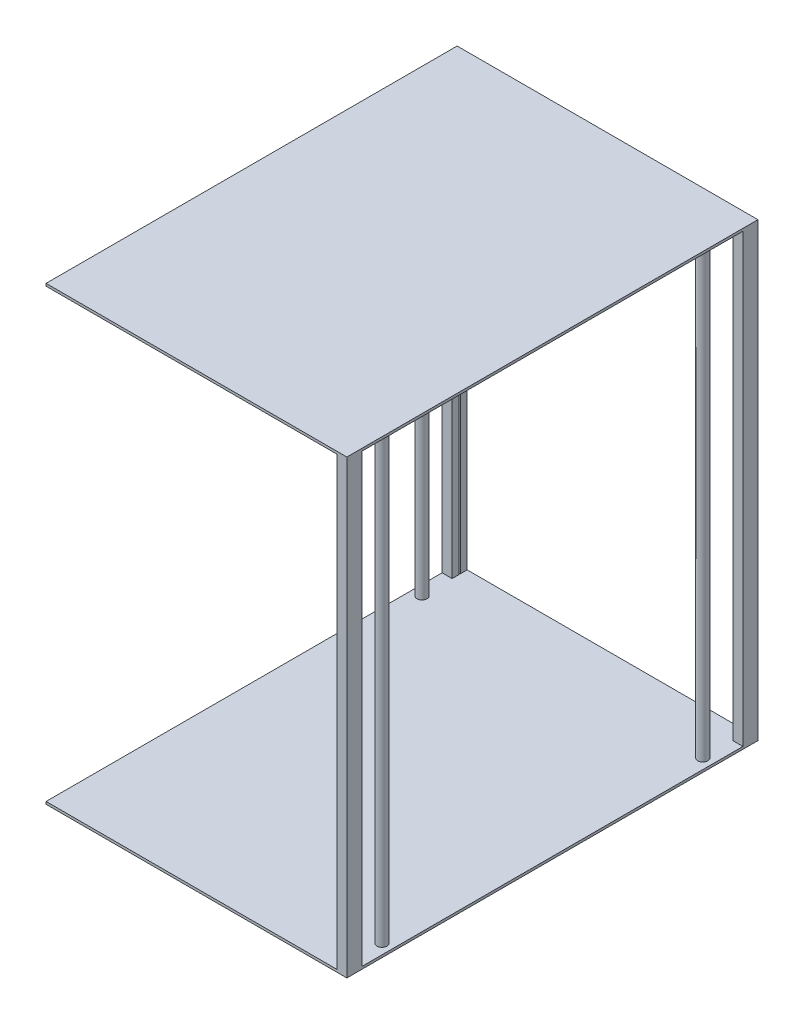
ISO-10303-21;
HEADER;
FILE_DESCRIPTION(('STEP AP214'),'2;1');
FILE_NAME('part.step','',(''),(''),'','','');
FILE_SCHEMA(('AUTOMOTIVE_DESIGN { 1 0 10303 214 1 1 1 1 }'));
ENDSEC;
DATA;
#1=APPLICATION_CONTEXT('core data for automotive mechanical design processes');
#2=APPLICATION_PROTOCOL_DEFINITION('international standard','automotive_design',2000,#1);
#3=PRODUCT_CONTEXT('',#1,'mechanical');
#4=PRODUCT('Part','Part','',(#3));
#5=PRODUCT_RELATED_PRODUCT_CATEGORY('part','',(#4));
#6=PRODUCT_DEFINITION_FORMATION('','',#4);
#7=PRODUCT_DEFINITION_CONTEXT('part definition',#1,'design');
#8=PRODUCT_DEFINITION('design','',#6,#7);
#9=PRODUCT_DEFINITION_SHAPE('','',#8);
#10=(LENGTH_UNIT() NAMED_UNIT(*) SI_UNIT(.MILLI.,.METRE.));
#11=(NAMED_UNIT(*) PLANE_ANGLE_UNIT() SI_UNIT($,.RADIAN.));
#12=(NAMED_UNIT(*) SI_UNIT($,.STERADIAN.) SOLID_ANGLE_UNIT());
#13=UNCERTAINTY_MEASURE_WITH_UNIT(LENGTH_MEASURE(1.E-05),#10,'distance_accuracy_value','');
#14=(GEOMETRIC_REPRESENTATION_CONTEXT(3) GLOBAL_UNCERTAINTY_ASSIGNED_CONTEXT((#13)) GLOBAL_UNIT_ASSIGNED_CONTEXT((#10,
#11,#12)) REPRESENTATION_CONTEXT('',''));
#15=CARTESIAN_POINT('',(0.,0.,0.));
#16=DIRECTION('',(0.,0.,1.));
#17=DIRECTION('',(1.,0.,0.));
#18=AXIS2_PLACEMENT_3D('',#15,#16,#17);
#19=CARTESIAN_POINT('',(-57.3913500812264,2286.,2053.31814208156));
#20=DIRECTION('',(0.,0.,-1.));
#21=DIRECTION('',(-1.,0.,0.));
#22=AXIS2_PLACEMENT_3D('',#19,#20,#21);
#23=PLANE('',#22);
#24=DIRECTION('',(1.,0.,0.));
#25=VECTOR('',#24,1.);
#26=CARTESIAN_POINT('',(-57.3913500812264,0.,2053.31814208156));
#27=LINE('',#26,#25);
#28=CARTESIAN_POINT('',(-57.3913500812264,0.,2053.31814208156));
#29=VERTEX_POINT('',#28);
#30=CARTESIAN_POINT('',(1466.60864991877,0.,2053.31814208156));
#31=VERTEX_POINT('',#30);
#32=EDGE_CURVE('E351',#29,#31,#27,.T.);
#33=ORIENTED_EDGE('',*,*,#32,.T.);
#34=DIRECTION('',(0.,-1.,0.));
#35=VECTOR('',#34,1.);
#36=CARTESIAN_POINT('',(1466.60864991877,2286.,2053.31814208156));
#37=LINE('',#36,#35);
#38=CARTESIAN_POINT('',(1466.60864991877,2286.,2053.31814208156));
#39=VERTEX_POINT('',#38);
#40=EDGE_CURVE('E361',#39,#31,#37,.T.);
#41=ORIENTED_EDGE('',*,*,#40,.F.);
#42=DIRECTION('',(1.,0.,0.));
#43=VECTOR('',#42,1.);
#44=CARTESIAN_POINT('',(-57.3913500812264,2286.,2053.31814208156));
#45=LINE('',#44,#43);
#46=CARTESIAN_POINT('',(-57.3913500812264,2286.,2053.31814208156));
#47=VERTEX_POINT('',#46);
#48=EDGE_CURVE('E203',#47,#39,#45,.T.);
#49=ORIENTED_EDGE('',*,*,#48,.F.);
#50=DIRECTION('',(0.,1.,0.));
#51=VECTOR('',#50,1.);
#52=CARTESIAN_POINT('',(-57.3913500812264,2273.3,2053.31814208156));
#53=LINE('',#52,#51);
#54=CARTESIAN_POINT('',(-57.3913500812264,2273.3,2053.31814208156));
#55=VERTEX_POINT('',#54);
#56=EDGE_CURVE('E188',#55,#47,#53,.T.);
#57=ORIENTED_EDGE('',*,*,#56,.F.);
#58=DIRECTION('',(1.,0.,0.));
#59=VECTOR('',#58,1.);
#60=CARTESIAN_POINT('',(1466.60864991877,2273.3,2053.31814208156));
#61=LINE('',#60,#59);
#62=CARTESIAN_POINT('',(1415.80864991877,2273.3,2053.31814208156));
#63=VERTEX_POINT('',#62);
#64=EDGE_CURVE('E193',#55,#63,#61,.T.);
#65=ORIENTED_EDGE('',*,*,#64,.T.);
#66=DIRECTION('',(0.,1.,0.));
#67=VECTOR('',#66,1.);
#68=CARTESIAN_POINT('',(1415.80864991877,12.7000000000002,2053.31814208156));
#69=LINE('',#68,#67);
#70=CARTESIAN_POINT('',(1415.80864991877,12.7000000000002,2053.31814208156));
#71=VERTEX_POINT('',#70);
#72=EDGE_CURVE('E295',#71,#63,#69,.T.);
#73=ORIENTED_EDGE('',*,*,#72,.F.);
#74=DIRECTION('',(1.,0.,0.));
#75=VECTOR('',#74,1.);
#76=CARTESIAN_POINT('',(-1302.9396218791,12.7000000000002,2053.31814208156));
#77=LINE('',#76,#75);
#78=CARTESIAN_POINT('',(-57.3913500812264,12.7000000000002,2053.31814208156));
#79=VERTEX_POINT('',#78);
#80=EDGE_CURVE('E245',#79,#71,#77,.T.);
#81=ORIENTED_EDGE('',*,*,#80,.F.);
#82=DIRECTION('',(0.,-1.,0.));
#83=VECTOR('',#82,1.);
#84=CARTESIAN_POINT('',(-57.3913500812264,2286.,2053.31814208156));
#85=LINE('',#84,#83);
#86=EDGE_CURVE('E362',#79,#29,#85,.T.);
#87=ORIENTED_EDGE('',*,*,#86,.T.);
#88=EDGE_LOOP('',(#33,#41,#49,#57,#65,#73,#81,#87));
#89=FACE_BOUND('',#88,.T.);
#90=ADVANCED_FACE('F33',(#89),#23,.F.);
#91=CARTESIAN_POINT('',(-57.3913500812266,2286.,-29.4818579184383));
#92=DIRECTION('',(1.,0.,0.));
#93=DIRECTION('',(0.,0.,-1.));
#94=AXIS2_PLACEMENT_3D('',#91,#92,#93);
#95=PLANE('',#94);
#96=DIRECTION('',(0.,1.,0.));
#97=VECTOR('',#96,1.);
#98=CARTESIAN_POINT('',(-57.3913500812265,12.7000000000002,46.7181420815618));
#99=LINE('',#98,#97);
#100=CARTESIAN_POINT('',(-57.3913500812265,12.7000000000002,46.7181420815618));
#101=VERTEX_POINT('',#100);
#102=CARTESIAN_POINT('',(-57.3913500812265,2273.3,46.7181420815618));
#103=VERTEX_POINT('',#102);
#104=EDGE_CURVE('E190',#101,#103,#99,.T.);
#105=ORIENTED_EDGE('',*,*,#104,.T.);
#106=DIRECTION('',(0.,0.,1.));
#107=VECTOR('',#106,1.);
#108=CARTESIAN_POINT('',(-57.3913500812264,2273.3,-29.4818579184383));
#109=LINE('',#108,#107);
#110=EDGE_CURVE('E185',#103,#55,#109,.T.);
#111=ORIENTED_EDGE('',*,*,#110,.T.);
#112=ORIENTED_EDGE('',*,*,#56,.T.);
#113=DIRECTION('',(0.,0.,1.));
#114=VECTOR('',#113,1.);
#115=CARTESIAN_POINT('',(-57.3913500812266,2286.,-29.4818579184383));
#116=LINE('',#115,#114);
#117=CARTESIAN_POINT('',(-57.3913500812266,2286.,-29.4818579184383));
#118=VERTEX_POINT('',#117);
#119=EDGE_CURVE('E340',#118,#47,#116,.T.);
#120=ORIENTED_EDGE('',*,*,#119,.F.);
#121=DIRECTION('',(0.,-1.,0.));
#122=VECTOR('',#121,1.);
#123=CARTESIAN_POINT('',(-57.3913500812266,2286.,-29.4818579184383));
#124=LINE('',#123,#122);
#125=CARTESIAN_POINT('',(-57.3913500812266,0.,-29.4818579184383));
#126=VERTEX_POINT('',#125);
#127=EDGE_CURVE('E348',#118,#126,#124,.T.);
#128=ORIENTED_EDGE('',*,*,#127,.T.);
#129=DIRECTION('',(0.,0.,1.));
#130=VECTOR('',#129,1.);
#131=CARTESIAN_POINT('',(-57.3913500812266,0.,-29.4818579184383));
#132=LINE('',#131,#130);
#133=EDGE_CURVE('E297',#126,#29,#132,.T.);
#134=ORIENTED_EDGE('',*,*,#133,.T.);
#135=ORIENTED_EDGE('',*,*,#86,.F.);
#136=DIRECTION('',(0.,0.,1.));
#137=VECTOR('',#136,1.);
#138=CARTESIAN_POINT('',(-57.3913500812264,12.7000000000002,1011.91814208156));
#139=LINE('',#138,#137);
#140=EDGE_CURVE('E243',#101,#79,#139,.T.);
#141=ORIENTED_EDGE('',*,*,#140,.F.);
#142=EDGE_LOOP('',(#105,#111,#112,#120,#128,#134,#135,#141));
#143=FACE_BOUND('',#142,.T.);
#144=ADVANCED_FACE('F35',(#143),#95,.F.);
#145=CARTESIAN_POINT('',(1466.60864991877,2286.,-29.4818579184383));
#146=DIRECTION('',(-1.,0.,0.));
#147=DIRECTION('',(0.,0.,1.));
#148=AXIS2_PLACEMENT_3D('',#145,#146,#147);
#149=PLANE('',#148);
#150=DIRECTION('',(0.,0.,-1.));
#151=VECTOR('',#150,1.);
#152=CARTESIAN_POINT('',(1466.60864991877,2273.3,-29.4818579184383));
#153=LINE('',#152,#151);
#154=CARTESIAN_POINT('',(1466.60864991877,2273.3,1977.11814208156));
#155=VERTEX_POINT('',#154);
#156=CARTESIAN_POINT('',(1466.60864991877,2273.3,46.7181420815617));
#157=VERTEX_POINT('',#156);
#158=EDGE_CURVE('E648',#155,#157,#153,.T.);
#159=ORIENTED_EDGE('',*,*,#158,.T.);
#160=DIRECTION('',(0.,1.,0.));
#161=VECTOR('',#160,1.);
#162=CARTESIAN_POINT('',(1466.60864991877,12.7000000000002,46.7181420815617));
#163=LINE('',#162,#161);
#164=CARTESIAN_POINT('',(1466.60864991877,12.7000000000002,46.7181420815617));
#165=VERTEX_POINT('',#164);
#166=EDGE_CURVE('E331',#165,#157,#163,.T.);
#167=ORIENTED_EDGE('',*,*,#166,.F.);
#168=DIRECTION('',(0.,0.,-1.));
#169=VECTOR('',#168,1.);
#170=CARTESIAN_POINT('',(1466.60864991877,12.7000000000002,1011.91814208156));
#171=LINE('',#170,#169);
#172=CARTESIAN_POINT('',(1466.60864991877,12.7000000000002,1977.11814208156));
#173=VERTEX_POINT('',#172);
#174=EDGE_CURVE('E252',#173,#165,#171,.T.);
#175=ORIENTED_EDGE('',*,*,#174,.F.);
#176=DIRECTION('',(0.,1.,0.));
#177=VECTOR('',#176,1.);
#178=CARTESIAN_POINT('',(1466.60864991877,12.7000000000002,1977.11814208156));
#179=LINE('',#178,#177);
#180=EDGE_CURVE('E333',#173,#155,#179,.T.);
#181=ORIENTED_EDGE('',*,*,#180,.T.);
#182=EDGE_LOOP('',(#159,#167,#175,#181));
#183=FACE_BOUND('',#182,.T.);
#184=DIRECTION('',(0.,0.,-1.));
#185=VECTOR('',#184,1.);
#186=CARTESIAN_POINT('',(1466.60864991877,0.,-29.4818579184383));
#187=LINE('',#186,#185);
#188=CARTESIAN_POINT('',(1466.60864991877,0.,-29.4818579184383));
#189=VERTEX_POINT('',#188);
#190=EDGE_CURVE('E353',#31,#189,#187,.T.);
#191=ORIENTED_EDGE('',*,*,#190,.T.);
#192=DIRECTION('',(0.,-1.,0.));
#193=VECTOR('',#192,1.);
#194=CARTESIAN_POINT('',(1466.60864991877,2286.,-29.4818579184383));
#195=LINE('',#194,#193);
#196=CARTESIAN_POINT('',(1466.60864991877,2286.,-29.4818579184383));
#197=VERTEX_POINT('',#196);
#198=EDGE_CURVE('E359',#197,#189,#195,.T.);
#199=ORIENTED_EDGE('',*,*,#198,.F.);
#200=DIRECTION('',(0.,0.,-1.));
#201=VECTOR('',#200,1.);
#202=CARTESIAN_POINT('',(1466.60864991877,2286.,-29.4818579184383));
#203=LINE('',#202,#201);
#204=EDGE_CURVE('E344',#39,#197,#203,.T.);
#205=ORIENTED_EDGE('',*,*,#204,.F.);
#206=ORIENTED_EDGE('',*,*,#40,.T.);
#207=EDGE_LOOP('',(#191,#199,#205,#206));
#208=FACE_BOUND('',#207,.T.);
#209=ADVANCED_FACE('F391',(#183,#208),#149,.F.);
#210=CARTESIAN_POINT('',(-57.3913500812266,2286.,-29.4818579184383));
#211=DIRECTION('',(0.,0.,1.));
#212=DIRECTION('',(1.,0.,0.));
#213=AXIS2_PLACEMENT_3D('',#210,#211,#212);
#214=PLANE('',#213);
#215=DIRECTION('',(-1.,0.,0.));
#216=VECTOR('',#215,1.);
#217=CARTESIAN_POINT('',(1466.60864991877,2273.3,-29.4818579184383));
#218=LINE('',#217,#216);
#219=CARTESIAN_POINT('',(1415.80864991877,2273.3,-29.4818579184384));
#220=VERTEX_POINT('',#219);
#221=CARTESIAN_POINT('',(-6.59135008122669,2273.3,-29.4818579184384));
#222=VERTEX_POINT('',#221);
#223=EDGE_CURVE('E194',#220,#222,#218,.T.);
#224=ORIENTED_EDGE('',*,*,#223,.T.);
#225=DIRECTION('',(0.,1.,0.));
#226=VECTOR('',#225,1.);
#227=CARTESIAN_POINT('',(-6.59135008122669,12.7000000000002,-29.4818579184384));
#228=LINE('',#227,#226);
#229=CARTESIAN_POINT('',(-6.59135008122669,12.7000000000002,-29.4818579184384));
#230=VERTEX_POINT('',#229);
#231=EDGE_CURVE('E311',#230,#222,#228,.T.);
#232=ORIENTED_EDGE('',*,*,#231,.F.);
#233=DIRECTION('',(-1.,0.,0.));
#234=VECTOR('',#233,1.);
#235=CARTESIAN_POINT('',(-1302.9396218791,12.7000000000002,-29.4818579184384));
#236=LINE('',#235,#234);
#237=CARTESIAN_POINT('',(1415.80864991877,12.7000000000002,-29.4818579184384));
#238=VERTEX_POINT('',#237);
#239=EDGE_CURVE('E268',#238,#230,#236,.T.);
#240=ORIENTED_EDGE('',*,*,#239,.F.);
#241=DIRECTION('',(0.,1.,0.));
#242=VECTOR('',#241,1.);
#243=CARTESIAN_POINT('',(1415.80864991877,12.7000000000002,-29.4818579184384));
#244=LINE('',#243,#242);
#245=EDGE_CURVE('E313',#238,#220,#244,.T.);
#246=ORIENTED_EDGE('',*,*,#245,.T.);
#247=EDGE_LOOP('',(#224,#232,#240,#246));
#248=FACE_BOUND('',#247,.T.);
#249=DIRECTION('',(-1.,0.,0.));
#250=VECTOR('',#249,1.);
#251=CARTESIAN_POINT('',(-57.3913500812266,0.,-29.4818579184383));
#252=LINE('',#251,#250);
#253=EDGE_CURVE('E342',#189,#126,#252,.T.);
#254=ORIENTED_EDGE('',*,*,#253,.T.);
#255=ORIENTED_EDGE('',*,*,#127,.F.);
#256=DIRECTION('',(-1.,0.,0.));
#257=VECTOR('',#256,1.);
#258=CARTESIAN_POINT('',(-57.3913500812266,2286.,-29.4818579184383));
#259=LINE('',#258,#257);
#260=EDGE_CURVE('E346',#197,#118,#259,.T.);
#261=ORIENTED_EDGE('',*,*,#260,.F.);
#262=ORIENTED_EDGE('',*,*,#198,.T.);
#263=EDGE_LOOP('',(#254,#255,#261,#262));
#264=FACE_BOUND('',#263,.T.);
#265=ADVANCED_FACE('F395',(#248,#264),#214,.F.);
#266=CARTESIAN_POINT('',(-57.3913500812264,2286.,2053.31814208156));
#267=DIRECTION('',(0.,1.,0.));
#268=DIRECTION('',(0.,0.,1.));
#269=AXIS2_PLACEMENT_3D('',#266,#267,#268);
#270=PLANE('',#269);
#271=ORIENTED_EDGE('',*,*,#119,.T.);
#272=ORIENTED_EDGE('',*,*,#48,.T.);
#273=ORIENTED_EDGE('',*,*,#204,.T.);
#274=ORIENTED_EDGE('',*,*,#260,.T.);
#275=EDGE_LOOP('',(#271,#272,#273,#274));
#276=FACE_BOUND('',#275,.T.);
#277=ADVANCED_FACE('F399',(#276),#270,.T.);
#278=CARTESIAN_POINT('',(-57.3913500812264,0.,2053.31814208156));
#279=DIRECTION('',(0.,1.,0.));
#280=DIRECTION('',(0.,0.,1.));
#281=AXIS2_PLACEMENT_3D('',#278,#279,#280);
#282=PLANE('',#281);
#283=ORIENTED_EDGE('',*,*,#133,.F.);
#284=ORIENTED_EDGE('',*,*,#253,.F.);
#285=ORIENTED_EDGE('',*,*,#190,.F.);
#286=ORIENTED_EDGE('',*,*,#32,.F.);
#287=EDGE_LOOP('',(#283,#284,#285,#286));
#288=FACE_BOUND('',#287,.T.);
#289=ADVANCED_FACE('F401',(#288),#282,.F.);
#290=CARTESIAN_POINT('',(-1302.9396218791,12.7000000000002,46.718142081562));
#291=DIRECTION('',(0.,0.,-1.));
#292=DIRECTION('',(-1.,0.,0.));
#293=AXIS2_PLACEMENT_3D('',#290,#291,#292);
#294=PLANE('',#293);
#295=DIRECTION('',(0.,1.,0.));
#296=VECTOR('',#295,1.);
#297=CARTESIAN_POINT('',(-6.59135008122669,12.7000000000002,46.7181420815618));
#298=LINE('',#297,#296);
#299=CARTESIAN_POINT('',(-6.59135008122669,12.7000000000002,46.7181420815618));
#300=VERTEX_POINT('',#299);
#301=CARTESIAN_POINT('',(-6.59135008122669,2273.3,46.7181420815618));
#302=VERTEX_POINT('',#301);
#303=EDGE_CURVE('E298',#300,#302,#298,.T.);
#304=ORIENTED_EDGE('',*,*,#303,.T.);
#305=DIRECTION('',(-1.,0.,0.));
#306=VECTOR('',#305,1.);
#307=CARTESIAN_POINT('',(-1302.9396218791,2273.3,46.718142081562));
#308=LINE('',#307,#306);
#309=EDGE_CURVE('E50',#302,#103,#308,.T.);
#310=ORIENTED_EDGE('',*,*,#309,.T.);
#311=ORIENTED_EDGE('',*,*,#104,.F.);
#312=DIRECTION('',(-1.,0.,0.));
#313=VECTOR('',#312,1.);
#314=CARTESIAN_POINT('',(-1302.9396218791,12.7000000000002,46.718142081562));
#315=LINE('',#314,#313);
#316=EDGE_CURVE('E283',#300,#101,#315,.T.);
#317=ORIENTED_EDGE('',*,*,#316,.F.);
#318=EDGE_LOOP('',(#304,#310,#311,#317));
#319=FACE_BOUND('',#318,.T.);
#320=ADVANCED_FACE('F404',(#319),#294,.F.);
#321=CARTESIAN_POINT('',(-6.59135008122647,12.7000000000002,1011.91814208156));
#322=DIRECTION('',(-1.,0.,0.));
#323=DIRECTION('',(0.,0.,1.));
#324=AXIS2_PLACEMENT_3D('',#321,#322,#323);
#325=PLANE('',#324);
#326=DIRECTION('',(0.,1.,0.));
#327=VECTOR('',#326,1.);
#328=CARTESIAN_POINT('',(-6.59135008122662,12.7000000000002,11.7931420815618));
#329=LINE('',#328,#327);
#330=CARTESIAN_POINT('',(-6.59135008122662,12.7000000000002,11.7931420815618));
#331=VERTEX_POINT('',#330);
#332=CARTESIAN_POINT('',(-6.59135008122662,2273.3,11.7931420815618));
#333=VERTEX_POINT('',#332);
#334=EDGE_CURVE('E300',#331,#333,#329,.T.);
#335=ORIENTED_EDGE('',*,*,#334,.T.);
#336=DIRECTION('',(0.,0.,1.));
#337=VECTOR('',#336,1.);
#338=CARTESIAN_POINT('',(-6.59135008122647,2273.3,1011.91814208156));
#339=LINE('',#338,#337);
#340=EDGE_CURVE('E58',#333,#302,#339,.T.);
#341=ORIENTED_EDGE('',*,*,#340,.T.);
#342=ORIENTED_EDGE('',*,*,#303,.F.);
#343=DIRECTION('',(0.,0.,1.));
#344=VECTOR('',#343,1.);
#345=CARTESIAN_POINT('',(-6.59135008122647,12.7000000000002,1011.91814208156));
#346=LINE('',#345,#344);
#347=EDGE_CURVE('E275',#331,#300,#346,.T.);
#348=ORIENTED_EDGE('',*,*,#347,.F.);
#349=EDGE_LOOP('',(#335,#341,#342,#348));
#350=FACE_BOUND('',#349,.T.);
#351=ADVANCED_FACE('F451',(#350),#325,.F.);
#352=CARTESIAN_POINT('',(-1302.9396218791,12.7000000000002,11.7931420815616));
#353=DIRECTION('',(0.,0.,-1.));
#354=DIRECTION('',(-1.,0.,0.));
#355=AXIS2_PLACEMENT_3D('',#352,#353,#354);
#356=PLANE('',#355);
#357=DIRECTION('',(-1.,0.,0.));
#358=VECTOR('',#357,1.);
#359=CARTESIAN_POINT('',(-1302.9396218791,2273.3,11.7931420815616));
#360=LINE('',#359,#358);
#361=CARTESIAN_POINT('',(-31.9913500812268,2273.3,11.7931420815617));
#362=VERTEX_POINT('',#361);
#363=EDGE_CURVE('E238',#333,#362,#360,.T.);
#364=ORIENTED_EDGE('',*,*,#363,.F.);
#365=ORIENTED_EDGE('',*,*,#334,.F.);
#366=DIRECTION('',(-1.,0.,0.));
#367=VECTOR('',#366,1.);
#368=CARTESIAN_POINT('',(-1302.9396218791,12.7000000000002,11.7931420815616));
#369=LINE('',#368,#367);
#370=CARTESIAN_POINT('',(-31.9913500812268,12.7000000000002,11.7931420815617));
#371=VERTEX_POINT('',#370);
#372=EDGE_CURVE('E281',#331,#371,#369,.T.);
#373=ORIENTED_EDGE('',*,*,#372,.T.);
#374=DIRECTION('',(0.,1.,0.));
#375=VECTOR('',#374,1.);
#376=CARTESIAN_POINT('',(-31.9913500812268,12.7000000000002,11.7931420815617));
#377=LINE('',#376,#375);
#378=EDGE_CURVE('E302',#371,#362,#377,.T.);
#379=ORIENTED_EDGE('',*,*,#378,.T.);
#380=EDGE_LOOP('',(#364,#365,#373,#379));
#381=FACE_BOUND('',#380,.T.);
#382=ADVANCED_FACE('F447',(#381),#356,.T.);
#383=CARTESIAN_POINT('',(-31.9913500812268,12.7000000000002,1011.91814208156));
#384=DIRECTION('',(-1.,0.,0.));
#385=DIRECTION('',(0.,0.,1.));
#386=AXIS2_PLACEMENT_3D('',#383,#384,#385);
#387=PLANE('',#386);
#388=DIRECTION('',(0.,1.,0.));
#389=VECTOR('',#388,1.);
#390=CARTESIAN_POINT('',(-31.9913500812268,12.7000000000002,5.44314208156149));
#391=LINE('',#390,#389);
#392=CARTESIAN_POINT('',(-31.9913500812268,12.7000000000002,5.44314208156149));
#393=VERTEX_POINT('',#392);
#394=CARTESIAN_POINT('',(-31.9913500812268,2273.3,5.44314208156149));
#395=VERTEX_POINT('',#394);
#396=EDGE_CURVE('E305',#393,#395,#391,.T.);
#397=ORIENTED_EDGE('',*,*,#396,.T.);
#398=DIRECTION('',(0.,0.,1.));
#399=VECTOR('',#398,1.);
#400=CARTESIAN_POINT('',(-31.9913500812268,2273.3,1011.91814208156));
#401=LINE('',#400,#399);
#402=EDGE_CURVE('E236',#395,#362,#401,.T.);
#403=ORIENTED_EDGE('',*,*,#402,.T.);
#404=ORIENTED_EDGE('',*,*,#378,.F.);
#405=DIRECTION('',(0.,0.,1.));
#406=VECTOR('',#405,1.);
#407=CARTESIAN_POINT('',(-31.9913500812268,12.7000000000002,1011.91814208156));
#408=LINE('',#407,#406);
#409=EDGE_CURVE('E278',#393,#371,#408,.T.);
#410=ORIENTED_EDGE('',*,*,#409,.F.);
#411=EDGE_LOOP('',(#397,#403,#404,#410));
#412=FACE_BOUND('',#411,.T.);
#413=ADVANCED_FACE('F443',(#412),#387,.F.);
#414=CARTESIAN_POINT('',(-1302.9396218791,12.7000000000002,5.44314208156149));
#415=DIRECTION('',(0.,0.,-1.));
#416=DIRECTION('',(-1.,0.,0.));
#417=AXIS2_PLACEMENT_3D('',#414,#415,#416);
#418=PLANE('',#417);
#419=DIRECTION('',(0.,1.,0.));
#420=VECTOR('',#419,1.);
#421=CARTESIAN_POINT('',(-6.59135008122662,12.7000000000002,5.44314208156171));
#422=LINE('',#421,#420);
#423=CARTESIAN_POINT('',(-6.59135008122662,12.7000000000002,5.44314208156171));
#424=VERTEX_POINT('',#423);
#425=CARTESIAN_POINT('',(-6.59135008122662,2273.3,5.44314208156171));
#426=VERTEX_POINT('',#425);
#427=EDGE_CURVE('E308',#424,#426,#422,.T.);
#428=ORIENTED_EDGE('',*,*,#427,.T.);
#429=DIRECTION('',(-1.,0.,0.));
#430=VECTOR('',#429,1.);
#431=CARTESIAN_POINT('',(-1302.9396218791,2273.3,5.44314208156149));
#432=LINE('',#431,#430);
#433=EDGE_CURVE('E234',#426,#395,#432,.T.);
#434=ORIENTED_EDGE('',*,*,#433,.T.);
#435=ORIENTED_EDGE('',*,*,#396,.F.);
#436=DIRECTION('',(-1.,0.,0.));
#437=VECTOR('',#436,1.);
#438=CARTESIAN_POINT('',(-1302.9396218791,12.7000000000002,5.44314208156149));
#439=LINE('',#438,#437);
#440=EDGE_CURVE('E274',#424,#393,#439,.T.);
#441=ORIENTED_EDGE('',*,*,#440,.F.);
#442=EDGE_LOOP('',(#428,#434,#435,#441));
#443=FACE_BOUND('',#442,.T.);
#444=ADVANCED_FACE('F440',(#443),#418,.F.);
#445=ORIENTED_EDGE('',*,*,#231,.T.);
#446=DIRECTION('',(0.,0.,1.));
#447=VECTOR('',#446,1.);
#448=CARTESIAN_POINT('',(-6.59135008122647,2273.3,1011.91814208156));
#449=LINE('',#448,#447);
#450=EDGE_CURVE('E232',#222,#426,#449,.T.);
#451=ORIENTED_EDGE('',*,*,#450,.T.);
#452=ORIENTED_EDGE('',*,*,#427,.F.);
#453=EDGE_CURVE('E271',#230,#424,#346,.T.);
#454=ORIENTED_EDGE('',*,*,#453,.F.);
#455=EDGE_LOOP('',(#445,#451,#452,#454));
#456=FACE_BOUND('',#455,.T.);
#457=ADVANCED_FACE('F438',(#456),#325,.F.);
#458=CARTESIAN_POINT('',(1415.80864991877,12.7000000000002,1011.91814208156));
#459=DIRECTION('',(-1.,0.,0.));
#460=DIRECTION('',(0.,0.,1.));
#461=AXIS2_PLACEMENT_3D('',#458,#459,#460);
#462=PLANE('',#461);
#463=DIRECTION('',(0.,0.,1.));
#464=VECTOR('',#463,1.);
#465=CARTESIAN_POINT('',(1415.80864991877,2273.3,1011.91814208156));
#466=LINE('',#465,#464);
#467=CARTESIAN_POINT('',(1415.80864991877,2273.3,5.44314208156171));
#468=VERTEX_POINT('',#467);
#469=EDGE_CURVE('E229',#220,#468,#466,.T.);
#470=ORIENTED_EDGE('',*,*,#469,.F.);
#471=ORIENTED_EDGE('',*,*,#245,.F.);
#472=DIRECTION('',(0.,0.,1.));
#473=VECTOR('',#472,1.);
#474=CARTESIAN_POINT('',(1415.80864991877,12.7000000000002,1011.91814208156));
#475=LINE('',#474,#473);
#476=CARTESIAN_POINT('',(1415.80864991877,12.7000000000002,5.44314208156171));
#477=VERTEX_POINT('',#476);
#478=EDGE_CURVE('E261',#238,#477,#475,.T.);
#479=ORIENTED_EDGE('',*,*,#478,.T.);
#480=DIRECTION('',(0.,1.,0.));
#481=VECTOR('',#480,1.);
#482=CARTESIAN_POINT('',(1415.80864991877,12.7000000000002,5.44314208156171));
#483=LINE('',#482,#481);
#484=EDGE_CURVE('E316',#477,#468,#483,.T.);
#485=ORIENTED_EDGE('',*,*,#484,.T.);
#486=EDGE_LOOP('',(#470,#471,#479,#485));
#487=FACE_BOUND('',#486,.T.);
#488=ADVANCED_FACE('F434',(#487),#462,.T.);
#489=CARTESIAN_POINT('',(-1302.9396218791,12.7000000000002,5.44314208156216));
#490=DIRECTION('',(0.,0.,1.));
#491=DIRECTION('',(1.,0.,0.));
#492=AXIS2_PLACEMENT_3D('',#489,#490,#491);
#493=PLANE('',#492);
#494=DIRECTION('',(1.,0.,0.));
#495=VECTOR('',#494,1.);
#496=CARTESIAN_POINT('',(-1302.9396218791,2273.3,5.44314208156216));
#497=LINE('',#496,#495);
#498=CARTESIAN_POINT('',(1441.20864991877,2273.3,5.44314208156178));
#499=VERTEX_POINT('',#498);
#500=EDGE_CURVE('E226',#468,#499,#497,.T.);
#501=ORIENTED_EDGE('',*,*,#500,.F.);
#502=ORIENTED_EDGE('',*,*,#484,.F.);
#503=DIRECTION('',(1.,0.,0.));
#504=VECTOR('',#503,1.);
#505=CARTESIAN_POINT('',(-1302.9396218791,12.7000000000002,5.44314208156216));
#506=LINE('',#505,#504);
#507=CARTESIAN_POINT('',(1441.20864991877,12.7000000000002,5.44314208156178));
#508=VERTEX_POINT('',#507);
#509=EDGE_CURVE('E266',#477,#508,#506,.T.);
#510=ORIENTED_EDGE('',*,*,#509,.T.);
#511=DIRECTION('',(0.,1.,0.));
#512=VECTOR('',#511,1.);
#513=CARTESIAN_POINT('',(1441.20864991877,12.7000000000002,5.44314208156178));
#514=LINE('',#513,#512);
#515=EDGE_CURVE('E319',#508,#499,#514,.T.);
#516=ORIENTED_EDGE('',*,*,#515,.T.);
#517=EDGE_LOOP('',(#501,#502,#510,#516));
#518=FACE_BOUND('',#517,.T.);
#519=ADVANCED_FACE('F430',(#518),#493,.T.);
#520=CARTESIAN_POINT('',(1441.20864991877,12.7000000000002,1011.91814208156));
#521=DIRECTION('',(-1.,0.,0.));
#522=DIRECTION('',(0.,0.,1.));
#523=AXIS2_PLACEMENT_3D('',#520,#521,#522);
#524=PLANE('',#523);
#525=DIRECTION('',(0.,0.,1.));
#526=VECTOR('',#525,1.);
#527=CARTESIAN_POINT('',(1441.20864991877,2273.3,1011.91814208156));
#528=LINE('',#527,#526);
#529=CARTESIAN_POINT('',(1441.20864991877,2273.3,11.7931420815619));
#530=VERTEX_POINT('',#529);
#531=EDGE_CURVE('E223',#499,#530,#528,.T.);
#532=ORIENTED_EDGE('',*,*,#531,.F.);
#533=ORIENTED_EDGE('',*,*,#515,.F.);
#534=DIRECTION('',(0.,0.,1.));
#535=VECTOR('',#534,1.);
#536=CARTESIAN_POINT('',(1441.20864991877,12.7000000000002,1011.91814208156));
#537=LINE('',#536,#535);
#538=CARTESIAN_POINT('',(1441.20864991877,12.7000000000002,11.7931420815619));
#539=VERTEX_POINT('',#538);
#540=EDGE_CURVE('E264',#508,#539,#537,.T.);
#541=ORIENTED_EDGE('',*,*,#540,.T.);
#542=DIRECTION('',(0.,1.,0.));
#543=VECTOR('',#542,1.);
#544=CARTESIAN_POINT('',(1441.20864991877,12.7000000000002,11.7931420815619));
#545=LINE('',#544,#543);
#546=EDGE_CURVE('E322',#539,#530,#545,.T.);
#547=ORIENTED_EDGE('',*,*,#546,.T.);
#548=EDGE_LOOP('',(#532,#533,#541,#547));
#549=FACE_BOUND('',#548,.T.);
#550=ADVANCED_FACE('F426',(#549),#524,.T.);
#551=CARTESIAN_POINT('',(-1302.9396218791,12.7000000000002,11.7931420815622));
#552=DIRECTION('',(0.,0.,1.));
#553=DIRECTION('',(1.,0.,0.));
#554=AXIS2_PLACEMENT_3D('',#551,#552,#553);
#555=PLANE('',#554);
#556=DIRECTION('',(0.,1.,0.));
#557=VECTOR('',#556,1.);
#558=CARTESIAN_POINT('',(1415.80864991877,12.7000000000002,11.7931420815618));
#559=LINE('',#558,#557);
#560=CARTESIAN_POINT('',(1415.80864991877,12.7000000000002,11.7931420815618));
#561=VERTEX_POINT('',#560);
#562=CARTESIAN_POINT('',(1415.80864991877,2273.3,11.7931420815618));
#563=VERTEX_POINT('',#562);
#564=EDGE_CURVE('E325',#561,#563,#559,.T.);
#565=ORIENTED_EDGE('',*,*,#564,.T.);
#566=DIRECTION('',(1.,0.,0.));
#567=VECTOR('',#566,1.);
#568=CARTESIAN_POINT('',(-1302.9396218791,2273.3,11.7931420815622));
#569=LINE('',#568,#567);
#570=EDGE_CURVE('E221',#563,#530,#569,.T.);
#571=ORIENTED_EDGE('',*,*,#570,.T.);
#572=ORIENTED_EDGE('',*,*,#546,.F.);
#573=DIRECTION('',(1.,0.,0.));
#574=VECTOR('',#573,1.);
#575=CARTESIAN_POINT('',(-1302.9396218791,12.7000000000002,11.7931420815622));
#576=LINE('',#575,#574);
#577=EDGE_CURVE('E260',#561,#539,#576,.T.);
#578=ORIENTED_EDGE('',*,*,#577,.F.);
#579=EDGE_LOOP('',(#565,#571,#572,#578));
#580=FACE_BOUND('',#579,.T.);
#581=ADVANCED_FACE('F423',(#580),#555,.F.);
#582=DIRECTION('',(0.,0.,1.));
#583=VECTOR('',#582,1.);
#584=CARTESIAN_POINT('',(1415.80864991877,2273.3,1011.91814208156));
#585=LINE('',#584,#583);
#586=CARTESIAN_POINT('',(1415.80864991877,2273.3,46.7181420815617));
#587=VERTEX_POINT('',#586);
#588=EDGE_CURVE('E218',#563,#587,#585,.T.);
#589=ORIENTED_EDGE('',*,*,#588,.F.);
#590=ORIENTED_EDGE('',*,*,#564,.F.);
#591=CARTESIAN_POINT('',(1415.80864991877,12.7000000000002,46.7181420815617));
#592=VERTEX_POINT('',#591);
#593=EDGE_CURVE('E258',#561,#592,#475,.T.);
#594=ORIENTED_EDGE('',*,*,#593,.T.);
#595=DIRECTION('',(0.,1.,0.));
#596=VECTOR('',#595,1.);
#597=CARTESIAN_POINT('',(1415.80864991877,12.7000000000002,46.7181420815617));
#598=LINE('',#597,#596);
#599=EDGE_CURVE('E328',#592,#587,#598,.T.);
#600=ORIENTED_EDGE('',*,*,#599,.T.);
#601=EDGE_LOOP('',(#589,#590,#594,#600));
#602=FACE_BOUND('',#601,.T.);
#603=ADVANCED_FACE('F421',(#602),#462,.T.);
#604=CARTESIAN_POINT('',(-1302.9396218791,12.7000000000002,46.718142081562));
#605=DIRECTION('',(0.,0.,-1.));
#606=DIRECTION('',(-1.,0.,0.));
#607=AXIS2_PLACEMENT_3D('',#604,#605,#606);
#608=PLANE('',#607);
#609=ORIENTED_EDGE('',*,*,#166,.T.);
#610=DIRECTION('',(-1.,0.,0.));
#611=VECTOR('',#610,1.);
#612=CARTESIAN_POINT('',(-1302.9396218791,2273.3,46.718142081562));
#613=LINE('',#612,#611);
#614=EDGE_CURVE('E216',#157,#587,#613,.T.);
#615=ORIENTED_EDGE('',*,*,#614,.T.);
#616=ORIENTED_EDGE('',*,*,#599,.F.);
#617=DIRECTION('',(-1.,0.,0.));
#618=VECTOR('',#617,1.);
#619=CARTESIAN_POINT('',(-1302.9396218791,12.7000000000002,46.718142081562));
#620=LINE('',#619,#618);
#621=EDGE_CURVE('E255',#165,#592,#620,.T.);
#622=ORIENTED_EDGE('',*,*,#621,.F.);
#623=EDGE_LOOP('',(#609,#615,#616,#622));
#624=FACE_BOUND('',#623,.T.);
#625=ADVANCED_FACE('F417',(#624),#608,.F.);
#626=CARTESIAN_POINT('',(-1302.9396218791,12.7000000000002,1977.11814208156));
#627=DIRECTION('',(0.,0.,-1.));
#628=DIRECTION('',(-1.,0.,0.));
#629=AXIS2_PLACEMENT_3D('',#626,#627,#628);
#630=PLANE('',#629);
#631=DIRECTION('',(-1.,0.,0.));
#632=VECTOR('',#631,1.);
#633=CARTESIAN_POINT('',(-1302.9396218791,2273.3,1977.11814208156));
#634=LINE('',#633,#632);
#635=CARTESIAN_POINT('',(1415.80864991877,2273.3,1977.11814208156));
#636=VERTEX_POINT('',#635);
#637=EDGE_CURVE('E214',#155,#636,#634,.T.);
#638=ORIENTED_EDGE('',*,*,#637,.F.);
#639=ORIENTED_EDGE('',*,*,#180,.F.);
#640=DIRECTION('',(-1.,0.,0.));
#641=VECTOR('',#640,1.);
#642=CARTESIAN_POINT('',(-1302.9396218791,12.7000000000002,1977.11814208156));
#643=LINE('',#642,#641);
#644=CARTESIAN_POINT('',(1415.80864991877,12.7000000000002,1977.11814208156));
#645=VERTEX_POINT('',#644);
#646=EDGE_CURVE('E250',#173,#645,#643,.T.);
#647=ORIENTED_EDGE('',*,*,#646,.T.);
#648=DIRECTION('',(0.,1.,0.));
#649=VECTOR('',#648,1.);
#650=CARTESIAN_POINT('',(1415.80864991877,12.7000000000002,1977.11814208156));
#651=LINE('',#650,#649);
#652=EDGE_CURVE('E336',#645,#636,#651,.T.);
#653=ORIENTED_EDGE('',*,*,#652,.T.);
#654=EDGE_LOOP('',(#638,#639,#647,#653));
#655=FACE_BOUND('',#654,.T.);
#656=ADVANCED_FACE('F413',(#655),#630,.T.);
#657=CARTESIAN_POINT('',(1415.80864991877,12.7000000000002,1011.91814208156));
#658=DIRECTION('',(-1.,0.,0.));
#659=DIRECTION('',(0.,0.,1.));
#660=AXIS2_PLACEMENT_3D('',#657,#658,#659);
#661=PLANE('',#660);
#662=DIRECTION('',(0.,0.,1.));
#663=VECTOR('',#662,1.);
#664=CARTESIAN_POINT('',(1415.80864991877,2273.3,1011.91814208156));
#665=LINE('',#664,#663);
#666=EDGE_CURVE('E204',#636,#63,#665,.T.);
#667=ORIENTED_EDGE('',*,*,#666,.F.);
#668=ORIENTED_EDGE('',*,*,#652,.F.);
#669=DIRECTION('',(0.,0.,1.));
#670=VECTOR('',#669,1.);
#671=CARTESIAN_POINT('',(1415.80864991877,12.7000000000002,1011.91814208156));
#672=LINE('',#671,#670);
#673=EDGE_CURVE('E248',#645,#71,#672,.T.);
#674=ORIENTED_EDGE('',*,*,#673,.T.);
#675=ORIENTED_EDGE('',*,*,#72,.T.);
#676=EDGE_LOOP('',(#667,#668,#674,#675));
#677=FACE_BOUND('',#676,.T.);
#678=ADVANCED_FACE('F409',(#677),#661,.T.);
#679=CARTESIAN_POINT('',(-6.59135008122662,12.7000000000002,199.118142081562));
#680=DIRECTION('',(0.,1.,0.));
#681=DIRECTION('',(0.,0.,1.));
#682=AXIS2_PLACEMENT_3D('',#679,#680,#681);
#683=CYLINDRICAL_SURFACE('',#682,25.4);
#684=CARTESIAN_POINT('',(-6.59135008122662,2273.3,199.118142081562));
#685=DIRECTION('',(0.,-1.,0.));
#686=DIRECTION('',(0.,0.,-1.));
#687=AXIS2_PLACEMENT_3D('',#684,#685,#686);
#688=CIRCLE('',#687,25.4);
#689=CARTESIAN_POINT('',(-6.59135008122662,2273.3,224.518142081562));
#690=VERTEX_POINT('',#689);
#691=EDGE_CURVE('E11',#690,#690,#688,.F.);
#692=CARTESIAN_POINT('',(-6.59135008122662,12.7000000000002,199.118142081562));
#693=DIRECTION('',(0.,1.,0.));
#694=DIRECTION('',(0.,0.,1.));
#695=AXIS2_PLACEMENT_3D('',#692,#693,#694);
#696=CIRCLE('',#695,25.4);
#697=CARTESIAN_POINT('',(-6.59135008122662,12.7000000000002,224.518142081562));
#698=VERTEX_POINT('',#697);
#699=EDGE_CURVE('E289',#698,#698,#696,.T.);
#700=CARTESIAN_POINT('',(-6.59135008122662,2273.3,224.518142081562));
#701=CARTESIAN_POINT('',(-6.59135008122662,2249.75208333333,224.518142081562));
#702=CARTESIAN_POINT('',(-6.59135008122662,2226.20416666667,224.518142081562));
#703=CARTESIAN_POINT('',(-6.59135008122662,2179.10833333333,224.518142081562));
#704=CARTESIAN_POINT('',(-6.59135008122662,2155.56041666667,224.518142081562));
#705=CARTESIAN_POINT('',(-6.59135008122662,2108.46458333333,224.518142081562));
#706=CARTESIAN_POINT('',(-6.59135008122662,2084.91666666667,224.518142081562));
#707=CARTESIAN_POINT('',(-6.59135008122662,2037.82083333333,224.518142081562));
#708=CARTESIAN_POINT('',(-6.59135008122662,2014.27291666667,224.518142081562));
#709=CARTESIAN_POINT('',(-6.59135008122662,1967.17708333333,224.518142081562));
#710=CARTESIAN_POINT('',(-6.59135008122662,1943.62916666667,224.518142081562));
#711=CARTESIAN_POINT('',(-6.59135008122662,1896.53333333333,224.518142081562));
#712=CARTESIAN_POINT('',(-6.59135008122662,1872.98541666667,224.518142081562));
#713=CARTESIAN_POINT('',(-6.59135008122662,1825.88958333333,224.518142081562));
#714=CARTESIAN_POINT('',(-6.59135008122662,1802.34166666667,224.518142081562));
#715=CARTESIAN_POINT('',(-6.59135008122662,1755.24583333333,224.518142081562));
#716=CARTESIAN_POINT('',(-6.59135008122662,1731.69791666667,224.518142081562));
#717=CARTESIAN_POINT('',(-6.59135008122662,1684.60208333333,224.518142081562));
#718=CARTESIAN_POINT('',(-6.59135008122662,1661.05416666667,224.518142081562));
#719=CARTESIAN_POINT('',(-6.59135008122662,1613.95833333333,224.518142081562));
#720=CARTESIAN_POINT('',(-6.59135008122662,1590.41041666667,224.518142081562));
#721=CARTESIAN_POINT('',(-6.59135008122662,1543.31458333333,224.518142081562));
#722=CARTESIAN_POINT('',(-6.59135008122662,1519.76666666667,224.518142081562));
#723=CARTESIAN_POINT('',(-6.59135008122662,1472.67083333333,224.518142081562));
#724=CARTESIAN_POINT('',(-6.59135008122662,1449.12291666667,224.518142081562));
#725=CARTESIAN_POINT('',(-6.59135008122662,1402.02708333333,224.518142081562));
#726=CARTESIAN_POINT('',(-6.59135008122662,1378.47916666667,224.518142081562));
#727=CARTESIAN_POINT('',(-6.59135008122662,1331.38333333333,224.518142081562));
#728=CARTESIAN_POINT('',(-6.59135008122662,1307.83541666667,224.518142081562));
#729=CARTESIAN_POINT('',(-6.59135008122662,1260.73958333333,224.518142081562));
#730=CARTESIAN_POINT('',(-6.59135008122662,1237.19166666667,224.518142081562));
#731=CARTESIAN_POINT('',(-6.59135008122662,1190.09583333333,224.518142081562));
#732=CARTESIAN_POINT('',(-6.59135008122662,1166.54791666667,224.518142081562));
#733=CARTESIAN_POINT('',(-6.59135008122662,1119.45208333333,224.518142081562));
#734=CARTESIAN_POINT('',(-6.59135008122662,1095.90416666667,224.518142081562));
#735=CARTESIAN_POINT('',(-6.59135008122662,1048.80833333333,224.518142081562));
#736=CARTESIAN_POINT('',(-6.59135008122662,1025.26041666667,224.518142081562));
#737=CARTESIAN_POINT('',(-6.59135008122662,978.164583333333,224.518142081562));
#738=CARTESIAN_POINT('',(-6.59135008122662,954.616666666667,224.518142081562));
#739=CARTESIAN_POINT('',(-6.59135008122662,907.520833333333,224.518142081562));
#740=CARTESIAN_POINT('',(-6.59135008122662,883.972916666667,224.518142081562));
#741=CARTESIAN_POINT('',(-6.59135008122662,836.877083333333,224.518142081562));
#742=CARTESIAN_POINT('',(-6.59135008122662,813.329166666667,224.518142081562));
#743=CARTESIAN_POINT('',(-6.59135008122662,766.233333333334,224.518142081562));
#744=CARTESIAN_POINT('',(-6.59135008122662,742.685416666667,224.518142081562));
#745=CARTESIAN_POINT('',(-6.59135008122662,695.589583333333,224.518142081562));
#746=CARTESIAN_POINT('',(-6.59135008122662,672.041666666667,224.518142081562));
#747=CARTESIAN_POINT('',(-6.59135008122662,624.945833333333,224.518142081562));
#748=CARTESIAN_POINT('',(-6.59135008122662,601.397916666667,224.518142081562));
#749=CARTESIAN_POINT('',(-6.59135008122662,554.302083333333,224.518142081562));
#750=CARTESIAN_POINT('',(-6.59135008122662,530.754166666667,224.518142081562));
#751=CARTESIAN_POINT('',(-6.59135008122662,483.658333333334,224.518142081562));
#752=CARTESIAN_POINT('',(-6.59135008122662,460.110416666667,224.518142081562));
#753=CARTESIAN_POINT('',(-6.59135008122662,413.014583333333,224.518142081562));
#754=CARTESIAN_POINT('',(-6.59135008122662,389.466666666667,224.518142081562));
#755=CARTESIAN_POINT('',(-6.59135008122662,342.370833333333,224.518142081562));
#756=CARTESIAN_POINT('',(-6.59135008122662,318.822916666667,224.518142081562));
#757=CARTESIAN_POINT('',(-6.59135008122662,271.727083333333,224.518142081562));
#758=CARTESIAN_POINT('',(-6.59135008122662,248.179166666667,224.518142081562));
#759=CARTESIAN_POINT('',(-6.59135008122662,201.083333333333,224.518142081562));
#760=CARTESIAN_POINT('',(-6.59135008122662,177.535416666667,224.518142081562));
#761=CARTESIAN_POINT('',(-6.59135008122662,130.439583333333,224.518142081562));
#762=CARTESIAN_POINT('',(-6.59135008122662,106.891666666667,224.518142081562));
#763=CARTESIAN_POINT('',(-6.59135008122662,59.7958333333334,224.518142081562));
#764=CARTESIAN_POINT('',(-6.59135008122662,36.2479166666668,224.518142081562));
#765=CARTESIAN_POINT('',(-6.59135008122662,12.7000000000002,224.518142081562));
#766=B_SPLINE_CURVE_WITH_KNOTS('',3,(#700,#701,#702,#703,#704,#705,#706,#707,#708,#709,#710,
#711,#712,#713,#714,#715,#716,#717,#718,#719,#720,#721,#722,#723,#724,#725,#726,#727,#728,#729,
#730,#731,#732,#733,#734,#735,#736,#737,#738,#739,#740,#741,#742,#743,#744,#745,#746,#747,#748,
#749,#750,#751,#752,#753,#754,#755,#756,#757,#758,#759,#760,#761,#762,#763,#764,#765),
.UNSPECIFIED.,.F.,.F.,(4,2,2,2,2,2,2,2,2,2,2,2,2,2,2,2,2,2,2,2,2,2,2,2,2,2,2,2,2,2,2,2,4),(0.,
70.6437499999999,141.2875,211.93125,282.575,353.21875,423.8625,494.50625,565.15,635.79375,
706.4375,777.08125,847.725,918.36875,989.0125,1059.65625,1130.3,1200.94375,1271.5875,1342.23125,
1412.875,1483.51875,1554.1625,1624.80625,1695.45,1766.09375,1836.7375,1907.38125,1978.025,
2048.66875,2119.3125,2189.95625,2260.6),.UNSPECIFIED.);
#767=EDGE_CURVE('BSEAM412',#690,#698,#766,.T.);
#768=ORIENTED_EDGE('',*,*,#691,.F.);
#769=ORIENTED_EDGE('',*,*,#699,.T.);
#770=ORIENTED_EDGE('',*,*,#767,.T.);
#771=ORIENTED_EDGE('',*,*,#767,.F.);
#772=EDGE_LOOP('',(#768,#770,#769,#771));
#773=FACE_BOUND('',#772,.T.);
#774=ADVANCED_FACE('F412',(#773),#683,.T.);
#775=CARTESIAN_POINT('',(1415.80864991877,12.7000000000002,1824.71814208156));
#776=DIRECTION('',(0.,1.,0.));
#777=DIRECTION('',(0.,0.,1.));
#778=AXIS2_PLACEMENT_3D('',#775,#776,#777);
#779=CYLINDRICAL_SURFACE('',#778,25.3999999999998);
#780=CARTESIAN_POINT('',(1415.80864991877,2273.3,1824.71814208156));
#781=DIRECTION('',(0.,-1.,0.));
#782=DIRECTION('',(0.,0.,-1.));
#783=AXIS2_PLACEMENT_3D('',#780,#781,#782);
#784=CIRCLE('',#783,25.3999999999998);
#785=CARTESIAN_POINT('',(1415.80864991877,2273.3,1850.11814208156));
#786=VERTEX_POINT('',#785);
#787=EDGE_CURVE('E42',#786,#786,#784,.F.);
#788=CARTESIAN_POINT('',(1415.80864991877,12.7000000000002,1824.71814208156));
#789=DIRECTION('',(0.,1.,0.));
#790=DIRECTION('',(0.,0.,1.));
#791=AXIS2_PLACEMENT_3D('',#788,#789,#790);
#792=CIRCLE('',#791,25.3999999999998);
#793=CARTESIAN_POINT('',(1415.80864991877,12.7000000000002,1850.11814208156));
#794=VERTEX_POINT('',#793);
#795=EDGE_CURVE('E286',#794,#794,#792,.T.);
#796=CARTESIAN_POINT('',(1415.80864991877,2273.3,1850.11814208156));
#797=CARTESIAN_POINT('',(1415.80864991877,2249.75208333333,1850.11814208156));
#798=CARTESIAN_POINT('',(1415.80864991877,2226.20416666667,1850.11814208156));
#799=CARTESIAN_POINT('',(1415.80864991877,2179.10833333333,1850.11814208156));
#800=CARTESIAN_POINT('',(1415.80864991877,2155.56041666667,1850.11814208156));
#801=CARTESIAN_POINT('',(1415.80864991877,2108.46458333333,1850.11814208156));
#802=CARTESIAN_POINT('',(1415.80864991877,2084.91666666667,1850.11814208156));
#803=CARTESIAN_POINT('',(1415.80864991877,2037.82083333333,1850.11814208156));
#804=CARTESIAN_POINT('',(1415.80864991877,2014.27291666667,1850.11814208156));
#805=CARTESIAN_POINT('',(1415.80864991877,1967.17708333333,1850.11814208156));
#806=CARTESIAN_POINT('',(1415.80864991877,1943.62916666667,1850.11814208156));
#807=CARTESIAN_POINT('',(1415.80864991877,1896.53333333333,1850.11814208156));
#808=CARTESIAN_POINT('',(1415.80864991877,1872.98541666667,1850.11814208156));
#809=CARTESIAN_POINT('',(1415.80864991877,1825.88958333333,1850.11814208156));
#810=CARTESIAN_POINT('',(1415.80864991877,1802.34166666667,1850.11814208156));
#811=CARTESIAN_POINT('',(1415.80864991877,1755.24583333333,1850.11814208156));
#812=CARTESIAN_POINT('',(1415.80864991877,1731.69791666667,1850.11814208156));
#813=CARTESIAN_POINT('',(1415.80864991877,1684.60208333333,1850.11814208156));
#814=CARTESIAN_POINT('',(1415.80864991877,1661.05416666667,1850.11814208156));
#815=CARTESIAN_POINT('',(1415.80864991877,1613.95833333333,1850.11814208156));
#816=CARTESIAN_POINT('',(1415.80864991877,1590.41041666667,1850.11814208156));
#817=CARTESIAN_POINT('',(1415.80864991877,1543.31458333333,1850.11814208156));
#818=CARTESIAN_POINT('',(1415.80864991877,1519.76666666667,1850.11814208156));
#819=CARTESIAN_POINT('',(1415.80864991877,1472.67083333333,1850.11814208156));
#820=CARTESIAN_POINT('',(1415.80864991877,1449.12291666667,1850.11814208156));
#821=CARTESIAN_POINT('',(1415.80864991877,1402.02708333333,1850.11814208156));
#822=CARTESIAN_POINT('',(1415.80864991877,1378.47916666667,1850.11814208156));
#823=CARTESIAN_POINT('',(1415.80864991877,1331.38333333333,1850.11814208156));
#824=CARTESIAN_POINT('',(1415.80864991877,1307.83541666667,1850.11814208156));
#825=CARTESIAN_POINT('',(1415.80864991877,1260.73958333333,1850.11814208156));
#826=CARTESIAN_POINT('',(1415.80864991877,1237.19166666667,1850.11814208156));
#827=CARTESIAN_POINT('',(1415.80864991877,1190.09583333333,1850.11814208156));
#828=CARTESIAN_POINT('',(1415.80864991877,1166.54791666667,1850.11814208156));
#829=CARTESIAN_POINT('',(1415.80864991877,1119.45208333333,1850.11814208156));
#830=CARTESIAN_POINT('',(1415.80864991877,1095.90416666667,1850.11814208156));
#831=CARTESIAN_POINT('',(1415.80864991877,1048.80833333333,1850.11814208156));
#832=CARTESIAN_POINT('',(1415.80864991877,1025.26041666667,1850.11814208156));
#833=CARTESIAN_POINT('',(1415.80864991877,978.164583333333,1850.11814208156));
#834=CARTESIAN_POINT('',(1415.80864991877,954.616666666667,1850.11814208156));
#835=CARTESIAN_POINT('',(1415.80864991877,907.520833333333,1850.11814208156));
#836=CARTESIAN_POINT('',(1415.80864991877,883.972916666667,1850.11814208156));
#837=CARTESIAN_POINT('',(1415.80864991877,836.877083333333,1850.11814208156));
#838=CARTESIAN_POINT('',(1415.80864991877,813.329166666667,1850.11814208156));
#839=CARTESIAN_POINT('',(1415.80864991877,766.233333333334,1850.11814208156));
#840=CARTESIAN_POINT('',(1415.80864991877,742.685416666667,1850.11814208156));
#841=CARTESIAN_POINT('',(1415.80864991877,695.589583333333,1850.11814208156));
#842=CARTESIAN_POINT('',(1415.80864991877,672.041666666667,1850.11814208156));
#843=CARTESIAN_POINT('',(1415.80864991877,624.945833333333,1850.11814208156));
#844=CARTESIAN_POINT('',(1415.80864991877,601.397916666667,1850.11814208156));
#845=CARTESIAN_POINT('',(1415.80864991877,554.302083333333,1850.11814208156));
#846=CARTESIAN_POINT('',(1415.80864991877,530.754166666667,1850.11814208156));
#847=CARTESIAN_POINT('',(1415.80864991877,483.658333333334,1850.11814208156));
#848=CARTESIAN_POINT('',(1415.80864991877,460.110416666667,1850.11814208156));
#849=CARTESIAN_POINT('',(1415.80864991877,413.014583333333,1850.11814208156));
#850=CARTESIAN_POINT('',(1415.80864991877,389.466666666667,1850.11814208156));
#851=CARTESIAN_POINT('',(1415.80864991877,342.370833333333,1850.11814208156));
#852=CARTESIAN_POINT('',(1415.80864991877,318.822916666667,1850.11814208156));
#853=CARTESIAN_POINT('',(1415.80864991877,271.727083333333,1850.11814208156));
#854=CARTESIAN_POINT('',(1415.80864991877,248.179166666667,1850.11814208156));
#855=CARTESIAN_POINT('',(1415.80864991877,201.083333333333,1850.11814208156));
#856=CARTESIAN_POINT('',(1415.80864991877,177.535416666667,1850.11814208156));
#857=CARTESIAN_POINT('',(1415.80864991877,130.439583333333,1850.11814208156));
#858=CARTESIAN_POINT('',(1415.80864991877,106.891666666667,1850.11814208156));
#859=CARTESIAN_POINT('',(1415.80864991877,59.7958333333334,1850.11814208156));
#860=CARTESIAN_POINT('',(1415.80864991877,36.2479166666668,1850.11814208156));
#861=CARTESIAN_POINT('',(1415.80864991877,12.7000000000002,1850.11814208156));
#862=B_SPLINE_CURVE_WITH_KNOTS('',3,(#796,#797,#798,#799,#800,#801,#802,#803,#804,#805,#806,
#807,#808,#809,#810,#811,#812,#813,#814,#815,#816,#817,#818,#819,#820,#821,#822,#823,#824,#825,
#826,#827,#828,#829,#830,#831,#832,#833,#834,#835,#836,#837,#838,#839,#840,#841,#842,#843,#844,
#845,#846,#847,#848,#849,#850,#851,#852,#853,#854,#855,#856,#857,#858,#859,#860,#861),
.UNSPECIFIED.,.F.,.F.,(4,2,2,2,2,2,2,2,2,2,2,2,2,2,2,2,2,2,2,2,2,2,2,2,2,2,2,2,2,2,2,2,4),(0.,
70.6437499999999,141.2875,211.93125,282.575,353.21875,423.8625,494.50625,565.15,635.79375,
706.4375,777.08125,847.725,918.36875,989.0125,1059.65625,1130.3,1200.94375,1271.5875,1342.23125,
1412.875,1483.51875,1554.1625,1624.80625,1695.45,1766.09375,1836.7375,1907.38125,1978.025,
2048.66875,2119.3125,2189.95625,2260.6),.UNSPECIFIED.);
#863=EDGE_CURVE('BSEAM375',#786,#794,#862,.T.);
#864=ORIENTED_EDGE('',*,*,#787,.F.);
#865=ORIENTED_EDGE('',*,*,#795,.T.);
#866=ORIENTED_EDGE('',*,*,#863,.T.);
#867=ORIENTED_EDGE('',*,*,#863,.F.);
#868=EDGE_LOOP('',(#864,#866,#865,#867));
#869=FACE_BOUND('',#868,.T.);
#870=ADVANCED_FACE('F375',(#869),#779,.T.);
#871=CARTESIAN_POINT('',(1415.80864991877,12.7000000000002,199.118142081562));
#872=DIRECTION('',(0.,1.,0.));
#873=DIRECTION('',(0.,0.,1.));
#874=AXIS2_PLACEMENT_3D('',#871,#872,#873);
#875=CYLINDRICAL_SURFACE('',#874,25.3999999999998);
#876=CARTESIAN_POINT('',(1415.80864991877,2273.3,199.118142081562));
#877=DIRECTION('',(0.,-1.,0.));
#878=DIRECTION('',(0.,0.,-1.));
#879=AXIS2_PLACEMENT_3D('',#876,#877,#878);
#880=CIRCLE('',#879,25.3999999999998);
#881=CARTESIAN_POINT('',(1415.80864991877,2273.3,224.518142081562));
#882=VERTEX_POINT('',#881);
#883=EDGE_CURVE('E37',#882,#882,#880,.F.);
#884=CARTESIAN_POINT('',(1415.80864991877,12.7000000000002,199.118142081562));
#885=DIRECTION('',(0.,1.,0.));
#886=DIRECTION('',(0.,0.,1.));
#887=AXIS2_PLACEMENT_3D('',#884,#885,#886);
#888=CIRCLE('',#887,25.3999999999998);
#889=CARTESIAN_POINT('',(1415.80864991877,12.7000000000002,224.518142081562));
#890=VERTEX_POINT('',#889);
#891=EDGE_CURVE('E292',#890,#890,#888,.T.);
#892=CARTESIAN_POINT('',(1415.80864991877,2273.3,224.518142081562));
#893=CARTESIAN_POINT('',(1415.80864991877,2249.75208333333,224.518142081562));
#894=CARTESIAN_POINT('',(1415.80864991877,2226.20416666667,224.518142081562));
#895=CARTESIAN_POINT('',(1415.80864991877,2179.10833333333,224.518142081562));
#896=CARTESIAN_POINT('',(1415.80864991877,2155.56041666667,224.518142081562));
#897=CARTESIAN_POINT('',(1415.80864991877,2108.46458333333,224.518142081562));
#898=CARTESIAN_POINT('',(1415.80864991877,2084.91666666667,224.518142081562));
#899=CARTESIAN_POINT('',(1415.80864991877,2037.82083333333,224.518142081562));
#900=CARTESIAN_POINT('',(1415.80864991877,2014.27291666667,224.518142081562));
#901=CARTESIAN_POINT('',(1415.80864991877,1967.17708333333,224.518142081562));
#902=CARTESIAN_POINT('',(1415.80864991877,1943.62916666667,224.518142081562));
#903=CARTESIAN_POINT('',(1415.80864991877,1896.53333333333,224.518142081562));
#904=CARTESIAN_POINT('',(1415.80864991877,1872.98541666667,224.518142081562));
#905=CARTESIAN_POINT('',(1415.80864991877,1825.88958333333,224.518142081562));
#906=CARTESIAN_POINT('',(1415.80864991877,1802.34166666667,224.518142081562));
#907=CARTESIAN_POINT('',(1415.80864991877,1755.24583333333,224.518142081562));
#908=CARTESIAN_POINT('',(1415.80864991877,1731.69791666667,224.518142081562));
#909=CARTESIAN_POINT('',(1415.80864991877,1684.60208333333,224.518142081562));
#910=CARTESIAN_POINT('',(1415.80864991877,1661.05416666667,224.518142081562));
#911=CARTESIAN_POINT('',(1415.80864991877,1613.95833333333,224.518142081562));
#912=CARTESIAN_POINT('',(1415.80864991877,1590.41041666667,224.518142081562));
#913=CARTESIAN_POINT('',(1415.80864991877,1543.31458333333,224.518142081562));
#914=CARTESIAN_POINT('',(1415.80864991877,1519.76666666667,224.518142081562));
#915=CARTESIAN_POINT('',(1415.80864991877,1472.67083333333,224.518142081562));
#916=CARTESIAN_POINT('',(1415.80864991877,1449.12291666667,224.518142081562));
#917=CARTESIAN_POINT('',(1415.80864991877,1402.02708333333,224.518142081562));
#918=CARTESIAN_POINT('',(1415.80864991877,1378.47916666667,224.518142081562));
#919=CARTESIAN_POINT('',(1415.80864991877,1331.38333333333,224.518142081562));
#920=CARTESIAN_POINT('',(1415.80864991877,1307.83541666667,224.518142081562));
#921=CARTESIAN_POINT('',(1415.80864991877,1260.73958333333,224.518142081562));
#922=CARTESIAN_POINT('',(1415.80864991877,1237.19166666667,224.518142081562));
#923=CARTESIAN_POINT('',(1415.80864991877,1190.09583333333,224.518142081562));
#924=CARTESIAN_POINT('',(1415.80864991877,1166.54791666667,224.518142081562));
#925=CARTESIAN_POINT('',(1415.80864991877,1119.45208333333,224.518142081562));
#926=CARTESIAN_POINT('',(1415.80864991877,1095.90416666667,224.518142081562));
#927=CARTESIAN_POINT('',(1415.80864991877,1048.80833333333,224.518142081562));
#928=CARTESIAN_POINT('',(1415.80864991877,1025.26041666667,224.518142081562));
#929=CARTESIAN_POINT('',(1415.80864991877,978.164583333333,224.518142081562));
#930=CARTESIAN_POINT('',(1415.80864991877,954.616666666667,224.518142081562));
#931=CARTESIAN_POINT('',(1415.80864991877,907.520833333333,224.518142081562));
#932=CARTESIAN_POINT('',(1415.80864991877,883.972916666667,224.518142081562));
#933=CARTESIAN_POINT('',(1415.80864991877,836.877083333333,224.518142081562));
#934=CARTESIAN_POINT('',(1415.80864991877,813.329166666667,224.518142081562));
#935=CARTESIAN_POINT('',(1415.80864991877,766.233333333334,224.518142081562));
#936=CARTESIAN_POINT('',(1415.80864991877,742.685416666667,224.518142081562));
#937=CARTESIAN_POINT('',(1415.80864991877,695.589583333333,224.518142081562));
#938=CARTESIAN_POINT('',(1415.80864991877,672.041666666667,224.518142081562));
#939=CARTESIAN_POINT('',(1415.80864991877,624.945833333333,224.518142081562));
#940=CARTESIAN_POINT('',(1415.80864991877,601.397916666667,224.518142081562));
#941=CARTESIAN_POINT('',(1415.80864991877,554.302083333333,224.518142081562));
#942=CARTESIAN_POINT('',(1415.80864991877,530.754166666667,224.518142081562));
#943=CARTESIAN_POINT('',(1415.80864991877,483.658333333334,224.518142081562));
#944=CARTESIAN_POINT('',(1415.80864991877,460.110416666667,224.518142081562));
#945=CARTESIAN_POINT('',(1415.80864991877,413.014583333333,224.518142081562));
#946=CARTESIAN_POINT('',(1415.80864991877,389.466666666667,224.518142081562));
#947=CARTESIAN_POINT('',(1415.80864991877,342.370833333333,224.518142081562));
#948=CARTESIAN_POINT('',(1415.80864991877,318.822916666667,224.518142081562));
#949=CARTESIAN_POINT('',(1415.80864991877,271.727083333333,224.518142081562));
#950=CARTESIAN_POINT('',(1415.80864991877,248.179166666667,224.518142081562));
#951=CARTESIAN_POINT('',(1415.80864991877,201.083333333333,224.518142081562));
#952=CARTESIAN_POINT('',(1415.80864991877,177.535416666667,224.518142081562));
#953=CARTESIAN_POINT('',(1415.80864991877,130.439583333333,224.518142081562));
#954=CARTESIAN_POINT('',(1415.80864991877,106.891666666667,224.518142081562));
#955=CARTESIAN_POINT('',(1415.80864991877,59.7958333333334,224.518142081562));
#956=CARTESIAN_POINT('',(1415.80864991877,36.2479166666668,224.518142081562));
#957=CARTESIAN_POINT('',(1415.80864991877,12.7000000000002,224.518142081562));
#958=B_SPLINE_CURVE_WITH_KNOTS('',3,(#892,#893,#894,#895,#896,#897,#898,#899,#900,#901,#902,
#903,#904,#905,#906,#907,#908,#909,#910,#911,#912,#913,#914,#915,#916,#917,#918,#919,#920,#921,
#922,#923,#924,#925,#926,#927,#928,#929,#930,#931,#932,#933,#934,#935,#936,#937,#938,#939,#940,
#941,#942,#943,#944,#945,#946,#947,#948,#949,#950,#951,#952,#953,#954,#955,#956,#957),
.UNSPECIFIED.,.F.,.F.,(4,2,2,2,2,2,2,2,2,2,2,2,2,2,2,2,2,2,2,2,2,2,2,2,2,2,2,2,2,2,2,2,4),(0.,
70.6437499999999,141.2875,211.93125,282.575,353.21875,423.8625,494.50625,565.15,635.79375,
706.4375,777.08125,847.725,918.36875,989.0125,1059.65625,1130.3,1200.94375,1271.5875,1342.23125,
1412.875,1483.51875,1554.1625,1624.80625,1695.45,1766.09375,1836.7375,1907.38125,1978.025,
2048.66875,2119.3125,2189.95625,2260.6),.UNSPECIFIED.);
#959=EDGE_CURVE('BSEAM371',#882,#890,#958,.T.);
#960=ORIENTED_EDGE('',*,*,#883,.F.);
#961=ORIENTED_EDGE('',*,*,#891,.T.);
#962=ORIENTED_EDGE('',*,*,#959,.T.);
#963=ORIENTED_EDGE('',*,*,#959,.F.);
#964=EDGE_LOOP('',(#960,#962,#961,#963));
#965=FACE_BOUND('',#964,.T.);
#966=ADVANCED_FACE('F371',(#965),#875,.T.);
#967=CARTESIAN_POINT('',(-1302.9396218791,12.7000000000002,1011.91814208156));
#968=DIRECTION('',(0.,1.,0.));
#969=DIRECTION('',(0.,0.,1.));
#970=AXIS2_PLACEMENT_3D('',#967,#968,#969);
#971=PLANE('',#970);
#972=ORIENTED_EDGE('',*,*,#140,.T.);
#973=ORIENTED_EDGE('',*,*,#80,.T.);
#974=ORIENTED_EDGE('',*,*,#673,.F.);
#975=ORIENTED_EDGE('',*,*,#646,.F.);
#976=ORIENTED_EDGE('',*,*,#174,.T.);
#977=ORIENTED_EDGE('',*,*,#621,.T.);
#978=ORIENTED_EDGE('',*,*,#593,.F.);
#979=ORIENTED_EDGE('',*,*,#577,.T.);
#980=ORIENTED_EDGE('',*,*,#540,.F.);
#981=ORIENTED_EDGE('',*,*,#509,.F.);
#982=ORIENTED_EDGE('',*,*,#478,.F.);
#983=ORIENTED_EDGE('',*,*,#239,.T.);
#984=ORIENTED_EDGE('',*,*,#453,.T.);
#985=ORIENTED_EDGE('',*,*,#440,.T.);
#986=ORIENTED_EDGE('',*,*,#409,.T.);
#987=ORIENTED_EDGE('',*,*,#372,.F.);
#988=ORIENTED_EDGE('',*,*,#347,.T.);
#989=ORIENTED_EDGE('',*,*,#316,.T.);
#990=EDGE_LOOP('',(#972,#973,#974,#975,#976,#977,#978,#979,#980,#981,#982,#983,#984,#985,#986,
#987,#988,#989));
#991=FACE_BOUND('',#990,.T.);
#992=ORIENTED_EDGE('',*,*,#795,.F.);
#993=EDGE_LOOP('',(#992));
#994=FACE_BOUND('',#993,.T.);
#995=ORIENTED_EDGE('',*,*,#699,.F.);
#996=EDGE_LOOP('',(#995));
#997=FACE_BOUND('',#996,.T.);
#998=ORIENTED_EDGE('',*,*,#891,.F.);
#999=EDGE_LOOP('',(#998));
#1000=FACE_BOUND('',#999,.T.);
#1001=ADVANCED_FACE('F374',(#991,#994,#997,#1000),#971,.T.);
#1002=CARTESIAN_POINT('',(1466.60864991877,2273.3,2053.31814208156));
#1003=DIRECTION('',(0.,-1.,0.));
#1004=DIRECTION('',(0.,0.,-1.));
#1005=AXIS2_PLACEMENT_3D('',#1002,#1003,#1004);
#1006=PLANE('',#1005);
#1007=ORIENTED_EDGE('',*,*,#883,.T.);
#1008=EDGE_LOOP('',(#1007));
#1009=FACE_BOUND('',#1008,.T.);
#1010=ORIENTED_EDGE('',*,*,#787,.T.);
#1011=EDGE_LOOP('',(#1010));
#1012=FACE_BOUND('',#1011,.T.);
#1013=ORIENTED_EDGE('',*,*,#691,.T.);
#1014=EDGE_LOOP('',(#1013));
#1015=FACE_BOUND('',#1014,.T.);
#1016=ORIENTED_EDGE('',*,*,#309,.F.);
#1017=ORIENTED_EDGE('',*,*,#340,.F.);
#1018=ORIENTED_EDGE('',*,*,#363,.T.);
#1019=ORIENTED_EDGE('',*,*,#402,.F.);
#1020=ORIENTED_EDGE('',*,*,#433,.F.);
#1021=ORIENTED_EDGE('',*,*,#450,.F.);
#1022=ORIENTED_EDGE('',*,*,#223,.F.);
#1023=ORIENTED_EDGE('',*,*,#469,.T.);
#1024=ORIENTED_EDGE('',*,*,#500,.T.);
#1025=ORIENTED_EDGE('',*,*,#531,.T.);
#1026=ORIENTED_EDGE('',*,*,#570,.F.);
#1027=ORIENTED_EDGE('',*,*,#588,.T.);
#1028=ORIENTED_EDGE('',*,*,#614,.F.);
#1029=ORIENTED_EDGE('',*,*,#158,.F.);
#1030=ORIENTED_EDGE('',*,*,#637,.T.);
#1031=ORIENTED_EDGE('',*,*,#666,.T.);
#1032=ORIENTED_EDGE('',*,*,#64,.F.);
#1033=ORIENTED_EDGE('',*,*,#110,.F.);
#1034=EDGE_LOOP('',(#1016,#1017,#1018,#1019,#1020,#1021,#1022,#1023,#1024,#1025,#1026,#1027,
#1028,#1029,#1030,#1031,#1032,#1033));
#1035=FACE_BOUND('',#1034,.T.);
#1036=ADVANCED_FACE('F206',(#1009,#1012,#1015,#1035),#1006,.T.);
#1037=CLOSED_SHELL('',(#90,#144,#209,#265,#277,#289,#320,#351,#382,#413,#444,#457,#488,#519,
#550,#581,#603,#625,#656,#678,#774,#870,#966,#1001,#1036));
#1038=MANIFOLD_SOLID_BREP('B2',#1037);
#1039=ADVANCED_BREP_SHAPE_REPRESENTATION('',(#18,#1038),#14);
#1040=SHAPE_DEFINITION_REPRESENTATION(#9,#1039);
ENDSEC;
END-ISO-10303-21;
